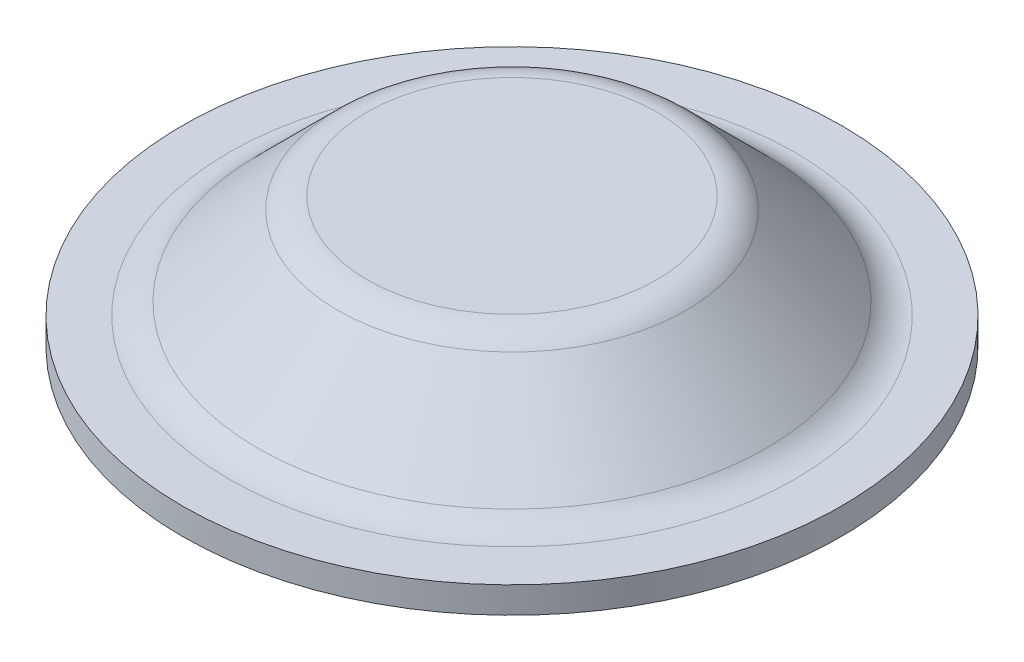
ISO-10303-21;
HEADER;
FILE_DESCRIPTION(('STEP AP214'),'2;1');
FILE_NAME('part.step','',(''),(''),'','','');
FILE_SCHEMA(('AUTOMOTIVE_DESIGN { 1 0 10303 214 1 1 1 1 }'));
ENDSEC;
DATA;
#1=APPLICATION_CONTEXT('core data for automotive mechanical design processes');
#2=APPLICATION_PROTOCOL_DEFINITION('international standard','automotive_design',2000,#1);
#3=PRODUCT_CONTEXT('',#1,'mechanical');
#4=PRODUCT('Part','Part','',(#3));
#5=PRODUCT_RELATED_PRODUCT_CATEGORY('part','',(#4));
#6=PRODUCT_DEFINITION_FORMATION('','',#4);
#7=PRODUCT_DEFINITION_CONTEXT('part definition',#1,'design');
#8=PRODUCT_DEFINITION('design','',#6,#7);
#9=PRODUCT_DEFINITION_SHAPE('','',#8);
#10=(LENGTH_UNIT() NAMED_UNIT(*) SI_UNIT(.MILLI.,.METRE.));
#11=(NAMED_UNIT(*) PLANE_ANGLE_UNIT() SI_UNIT($,.RADIAN.));
#12=(NAMED_UNIT(*) SI_UNIT($,.STERADIAN.) SOLID_ANGLE_UNIT());
#13=UNCERTAINTY_MEASURE_WITH_UNIT(LENGTH_MEASURE(1.E-05),#10,'distance_accuracy_value','');
#14=(GEOMETRIC_REPRESENTATION_CONTEXT(3) GLOBAL_UNCERTAINTY_ASSIGNED_CONTEXT((#13)) GLOBAL_UNIT_ASSIGNED_CONTEXT((#10,
#11,#12)) REPRESENTATION_CONTEXT('',''));
#15=CARTESIAN_POINT('',(0.,0.,0.));
#16=DIRECTION('',(0.,0.,1.));
#17=DIRECTION('',(1.,0.,0.));
#18=AXIS2_PLACEMENT_3D('',#15,#16,#17);
#19=CARTESIAN_POINT('',(0.,-2.032,0.));
#20=DIRECTION('',(0.,1.,0.));
#21=DIRECTION('',(0.,0.,1.));
#22=AXIS2_PLACEMENT_3D('',#19,#20,#21);
#23=PLANE('',#22);
#24=CARTESIAN_POINT('',(0.,-2.032,0.));
#25=DIRECTION('',(0.,1.,0.));
#26=DIRECTION('',(0.,0.,-1.));
#27=AXIS2_PLACEMENT_3D('',#24,#25,#26);
#28=CIRCLE('',#27,11.1816719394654);
#29=CARTESIAN_POINT('',(0.,-2.032,11.1816719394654));
#30=VERTEX_POINT('',#29);
#31=CARTESIAN_POINT('',(0.,-2.032,-11.1816719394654));
#32=VERTEX_POINT('',#31);
#33=EDGE_CURVE('E60',#30,#32,#28,.F.);
#34=ORIENTED_EDGE('',*,*,#33,.T.);
#35=CARTESIAN_POINT('',(0.,-2.032,0.));
#36=DIRECTION('',(0.,1.,0.));
#37=DIRECTION('',(0.,0.,1.));
#38=AXIS2_PLACEMENT_3D('',#35,#36,#37);
#39=CIRCLE('',#38,11.1816719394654);
#40=EDGE_CURVE('E57',#32,#30,#39,.F.);
#41=ORIENTED_EDGE('',*,*,#40,.T.);
#42=EDGE_LOOP('',(#34,#41));
#43=FACE_BOUND('',#42,.T.);
#44=ADVANCED_FACE('F18',(#43),#23,.F.);
#45=CARTESIAN_POINT('',(0.,-3.175,0.));
#46=DIRECTION('',(0.,1.,0.));
#47=DIRECTION('',(0.,0.,1.));
#48=AXIS2_PLACEMENT_3D('',#45,#46,#47);
#49=TOROIDAL_SURFACE('',#48,11.1816719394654,1.143);
#50=CARTESIAN_POINT('',(0.,-2.36677694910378,0.));
#51=DIRECTION('',(0.,-1.,0.));
#52=DIRECTION('',(0.,0.,-1.));
#53=AXIS2_PLACEMENT_3D('',#50,#51,#52);
#54=CIRCLE('',#53,11.9898949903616);
#55=CARTESIAN_POINT('',(0.,-2.36677694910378,-11.9898949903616));
#56=VERTEX_POINT('',#55);
#57=EDGE_CURVE('E66',#56,#56,#54,.T.);
#58=ORIENTED_EDGE('',*,*,#57,.T.);
#59=EDGE_LOOP('',(#58));
#60=FACE_BOUND('',#59,.T.);
#61=ORIENTED_EDGE('',*,*,#33,.F.);
#62=ORIENTED_EDGE('',*,*,#40,.F.);
#63=EDGE_LOOP('',(#61,#62));
#64=FACE_BOUND('',#63,.T.);
#65=ADVANCED_FACE('F61',(#60,#64),#49,.F.);
#66=CARTESIAN_POINT('',(0.,0.,0.));
#67=DIRECTION('',(0.,-1.,0.));
#68=DIRECTION('',(0.,0.,-1.));
#69=AXIS2_PLACEMENT_3D('',#66,#67,#68);
#70=PLANE('',#69);
#71=CARTESIAN_POINT('',(0.,0.,0.));
#72=DIRECTION('',(0.,-1.,0.));
#73=DIRECTION('',(0.,0.,1.));
#74=AXIS2_PLACEMENT_3D('',#71,#72,#73);
#75=CIRCLE('',#74,11.1816719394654);
#76=CARTESIAN_POINT('',(0.,0.,11.1816719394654));
#77=VERTEX_POINT('',#76);
#78=CARTESIAN_POINT('',(0.,0.,-11.1816719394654));
#79=VERTEX_POINT('',#78);
#80=EDGE_CURVE('E100',#77,#79,#75,.T.);
#81=ORIENTED_EDGE('',*,*,#80,.F.);
#82=CARTESIAN_POINT('',(0.,0.,0.));
#83=DIRECTION('',(0.,-1.,0.));
#84=DIRECTION('',(0.,0.,-1.));
#85=AXIS2_PLACEMENT_3D('',#82,#83,#84);
#86=CIRCLE('',#85,11.1816719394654);
#87=EDGE_CURVE('E131',#79,#77,#86,.T.);
#88=ORIENTED_EDGE('',*,*,#87,.F.);
#89=EDGE_LOOP('',(#81,#88));
#90=FACE_BOUND('',#89,.T.);
#91=ADVANCED_FACE('F91',(#90),#70,.F.);
#92=CARTESIAN_POINT('',(0.,-8.50790500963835,0.));
#93=DIRECTION('',(0.,-1.,0.));
#94=DIRECTION('',(0.,0.,-1.));
#95=AXIS2_PLACEMENT_3D('',#92,#93,#94);
#96=CONICAL_SURFACE('',#95,18.1310230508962,0.785398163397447);
#97=ORIENTED_EDGE('',*,*,#57,.F.);
#98=EDGE_LOOP('',(#97));
#99=FACE_BOUND('',#98,.T.);
#100=CARTESIAN_POINT('',(0.,-8.50790500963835,0.));
#101=DIRECTION('',(0.,1.,0.));
#102=DIRECTION('',(0.,0.,1.));
#103=AXIS2_PLACEMENT_3D('',#100,#101,#102);
#104=CIRCLE('',#103,18.1310230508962);
#105=CARTESIAN_POINT('',(0.,-8.50790500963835,18.1310230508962));
#106=VERTEX_POINT('',#105);
#107=EDGE_CURVE('E128',#106,#106,#104,.T.);
#108=ORIENTED_EDGE('',*,*,#107,.F.);
#109=EDGE_LOOP('',(#108));
#110=FACE_BOUND('',#109,.T.);
#111=ADVANCED_FACE('F117',(#99,#110),#96,.F.);
#112=CARTESIAN_POINT('',(0.,-3.175,0.));
#113=DIRECTION('',(0.,1.,0.));
#114=DIRECTION('',(0.,0.,1.));
#115=AXIS2_PLACEMENT_3D('',#112,#113,#114);
#116=TOROIDAL_SURFACE('',#115,11.1816719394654,3.175);
#117=ORIENTED_EDGE('',*,*,#80,.T.);
#118=ORIENTED_EDGE('',*,*,#87,.T.);
#119=EDGE_LOOP('',(#117,#118));
#120=FACE_BOUND('',#119,.T.);
#121=CARTESIAN_POINT('',(0.,-0.929935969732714,0.));
#122=DIRECTION('',(0.,-1.,0.));
#123=DIRECTION('',(0.,0.,-1.));
#124=AXIS2_PLACEMENT_3D('',#121,#122,#123);
#125=CIRCLE('',#124,13.4267359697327);
#126=CARTESIAN_POINT('',(0.,-0.929935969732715,-13.4267359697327));
#127=VERTEX_POINT('',#126);
#128=EDGE_CURVE('E126',#127,#127,#125,.T.);
#129=ORIENTED_EDGE('',*,*,#128,.F.);
#130=EDGE_LOOP('',(#129));
#131=FACE_BOUND('',#130,.T.);
#132=ADVANCED_FACE('F106',(#120,#131),#116,.T.);
#133=CARTESIAN_POINT('',(0.,-4.826,0.));
#134=DIRECTION('',(0.,1.,0.));
#135=DIRECTION('',(0.,0.,1.));
#136=AXIS2_PLACEMENT_3D('',#133,#134,#135);
#137=TOROIDAL_SURFACE('',#136,21.8129280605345,5.207);
#138=CARTESIAN_POINT('',(0.,-10.033,0.));
#139=DIRECTION('',(0.,-1.,0.));
#140=DIRECTION('',(0.,0.,1.));
#141=AXIS2_PLACEMENT_3D('',#138,#139,#140);
#142=CIRCLE('',#141,21.8129280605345);
#143=CARTESIAN_POINT('',(0.,-10.033,21.8129280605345));
#144=VERTEX_POINT('',#143);
#145=CARTESIAN_POINT('',(0.,-10.033,-21.8129280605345));
#146=VERTEX_POINT('',#145);
#147=EDGE_CURVE('E173',#144,#146,#142,.T.);
#148=ORIENTED_EDGE('',*,*,#147,.T.);
#149=CARTESIAN_POINT('',(0.,-10.033,0.));
#150=DIRECTION('',(0.,-1.,0.));
#151=DIRECTION('',(0.,0.,-1.));
#152=AXIS2_PLACEMENT_3D('',#149,#150,#151);
#153=CIRCLE('',#152,21.8129280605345);
#154=EDGE_CURVE('E221',#146,#144,#153,.T.);
#155=ORIENTED_EDGE('',*,*,#154,.T.);
#156=EDGE_LOOP('',(#148,#155));
#157=FACE_BOUND('',#156,.T.);
#158=ORIENTED_EDGE('',*,*,#107,.T.);
#159=EDGE_LOOP('',(#158));
#160=FACE_BOUND('',#159,.T.);
#161=ADVANCED_FACE('F116',(#157,#160),#137,.T.);
#162=CARTESIAN_POINT('',(0.,-7.07106403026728,0.));
#163=DIRECTION('',(0.,-1.,0.));
#164=DIRECTION('',(1.,0.,0.));
#165=AXIS2_PLACEMENT_3D('',#162,#163,#164);
#166=CONICAL_SURFACE('',#165,19.5678640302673,0.785398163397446);
#167=CARTESIAN_POINT('',(0.,-7.07106403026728,0.));
#168=DIRECTION('',(0.,1.,0.));
#169=DIRECTION('',(0.,0.,1.));
#170=AXIS2_PLACEMENT_3D('',#167,#168,#169);
#171=CIRCLE('',#170,19.5678640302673);
#172=CARTESIAN_POINT('',(0.,-7.07106403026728,19.5678640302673));
#173=VERTEX_POINT('',#172);
#174=EDGE_CURVE('E225',#173,#173,#171,.T.);
#175=ORIENTED_EDGE('',*,*,#174,.T.);
#176=EDGE_LOOP('',(#175));
#177=FACE_BOUND('',#176,.T.);
#178=ORIENTED_EDGE('',*,*,#128,.T.);
#179=EDGE_LOOP('',(#178));
#180=FACE_BOUND('',#179,.T.);
#181=ADVANCED_FACE('F246',(#177,#180),#166,.T.);
#182=CARTESIAN_POINT('',(21.8129280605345,-10.033,0.));
#183=DIRECTION('',(0.,1.,0.));
#184=DIRECTION('',(0.,0.,1.));
#185=AXIS2_PLACEMENT_3D('',#182,#183,#184);
#186=PLANE('',#185);
#187=ORIENTED_EDGE('',*,*,#147,.F.);
#188=ORIENTED_EDGE('',*,*,#154,.F.);
#189=EDGE_LOOP('',(#187,#188));
#190=FACE_BOUND('',#189,.T.);
#191=CARTESIAN_POINT('',(0.,-10.033,0.));
#192=DIRECTION('',(0.,1.,0.));
#193=DIRECTION('',(0.,0.,1.));
#194=AXIS2_PLACEMENT_3D('',#191,#192,#193);
#195=CIRCLE('',#194,25.4);
#196=CARTESIAN_POINT('',(0.,-10.033,25.4));
#197=VERTEX_POINT('',#196);
#198=EDGE_CURVE('E232',#197,#197,#195,.T.);
#199=ORIENTED_EDGE('',*,*,#198,.F.);
#200=EDGE_LOOP('',(#199));
#201=FACE_BOUND('',#200,.T.);
#202=ADVANCED_FACE('F190',(#190,#201),#186,.F.);
#203=CARTESIAN_POINT('',(0.,-4.826,0.));
#204=DIRECTION('',(0.,1.,0.));
#205=DIRECTION('',(0.,0.,1.));
#206=AXIS2_PLACEMENT_3D('',#203,#204,#205);
#207=TOROIDAL_SURFACE('',#206,21.8129280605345,3.175);
#208=ORIENTED_EDGE('',*,*,#174,.F.);
#209=EDGE_LOOP('',(#208));
#210=FACE_BOUND('',#209,.T.);
#211=CARTESIAN_POINT('',(0.,-8.001,0.));
#212=DIRECTION('',(0.,1.,0.));
#213=DIRECTION('',(0.,0.,-1.));
#214=AXIS2_PLACEMENT_3D('',#211,#212,#213);
#215=CIRCLE('',#214,21.8129280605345);
#216=CARTESIAN_POINT('',(0.,-8.001,-21.8129280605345));
#217=VERTEX_POINT('',#216);
#218=CARTESIAN_POINT('',(0.,-8.001,21.8129280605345));
#219=VERTEX_POINT('',#218);
#220=EDGE_CURVE('E273',#217,#219,#215,.T.);
#221=ORIENTED_EDGE('',*,*,#220,.T.);
#222=CARTESIAN_POINT('',(0.,-8.001,0.));
#223=DIRECTION('',(0.,1.,0.));
#224=DIRECTION('',(0.,0.,1.));
#225=AXIS2_PLACEMENT_3D('',#222,#223,#224);
#226=CIRCLE('',#225,21.8129280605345);
#227=EDGE_CURVE('E29',#219,#217,#226,.T.);
#228=ORIENTED_EDGE('',*,*,#227,.T.);
#229=EDGE_LOOP('',(#221,#228));
#230=FACE_BOUND('',#229,.T.);
#231=ADVANCED_FACE('F178',(#210,#230),#207,.F.);
#232=CARTESIAN_POINT('',(0.,0.,0.));
#233=DIRECTION('',(0.,1.,0.));
#234=DIRECTION('',(0.,0.,1.));
#235=AXIS2_PLACEMENT_3D('',#232,#233,#234);
#236=CYLINDRICAL_SURFACE('',#235,25.4);
#237=CARTESIAN_POINT('',(0.,-8.001,0.));
#238=DIRECTION('',(0.,1.,0.));
#239=DIRECTION('',(0.,0.,1.));
#240=AXIS2_PLACEMENT_3D('',#237,#238,#239);
#241=CIRCLE('',#240,25.4);
#242=CARTESIAN_POINT('',(0.,-8.001,25.4));
#243=VERTEX_POINT('',#242);
#244=EDGE_CURVE('E11',#243,#243,#241,.F.);
#245=ORIENTED_EDGE('',*,*,#244,.T.);
#246=EDGE_LOOP('',(#245));
#247=FACE_BOUND('',#246,.T.);
#248=ORIENTED_EDGE('',*,*,#198,.T.);
#249=EDGE_LOOP('',(#248));
#250=FACE_BOUND('',#249,.T.);
#251=ADVANCED_FACE('F189',(#247,#250),#236,.T.);
#252=CARTESIAN_POINT('',(21.8129280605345,-8.001,0.));
#253=DIRECTION('',(0.,-1.,0.));
#254=DIRECTION('',(0.,0.,-1.));
#255=AXIS2_PLACEMENT_3D('',#252,#253,#254);
#256=PLANE('',#255);
#257=ORIENTED_EDGE('',*,*,#244,.F.);
#258=EDGE_LOOP('',(#257));
#259=FACE_BOUND('',#258,.T.);
#260=ORIENTED_EDGE('',*,*,#220,.F.);
#261=ORIENTED_EDGE('',*,*,#227,.F.);
#262=EDGE_LOOP('',(#260,#261));
#263=FACE_BOUND('',#262,.T.);
#264=ADVANCED_FACE('F254',(#259,#263),#256,.F.);
#265=CLOSED_SHELL('',(#44,#65,#91,#111,#132,#161,#181,#202,#231,#251,#264));
#266=MANIFOLD_SOLID_BREP('B1',#265);
#267=ADVANCED_BREP_SHAPE_REPRESENTATION('',(#18,#266),#14);
#268=SHAPE_DEFINITION_REPRESENTATION(#9,#267);
ENDSEC;
END-ISO-10303-21;
